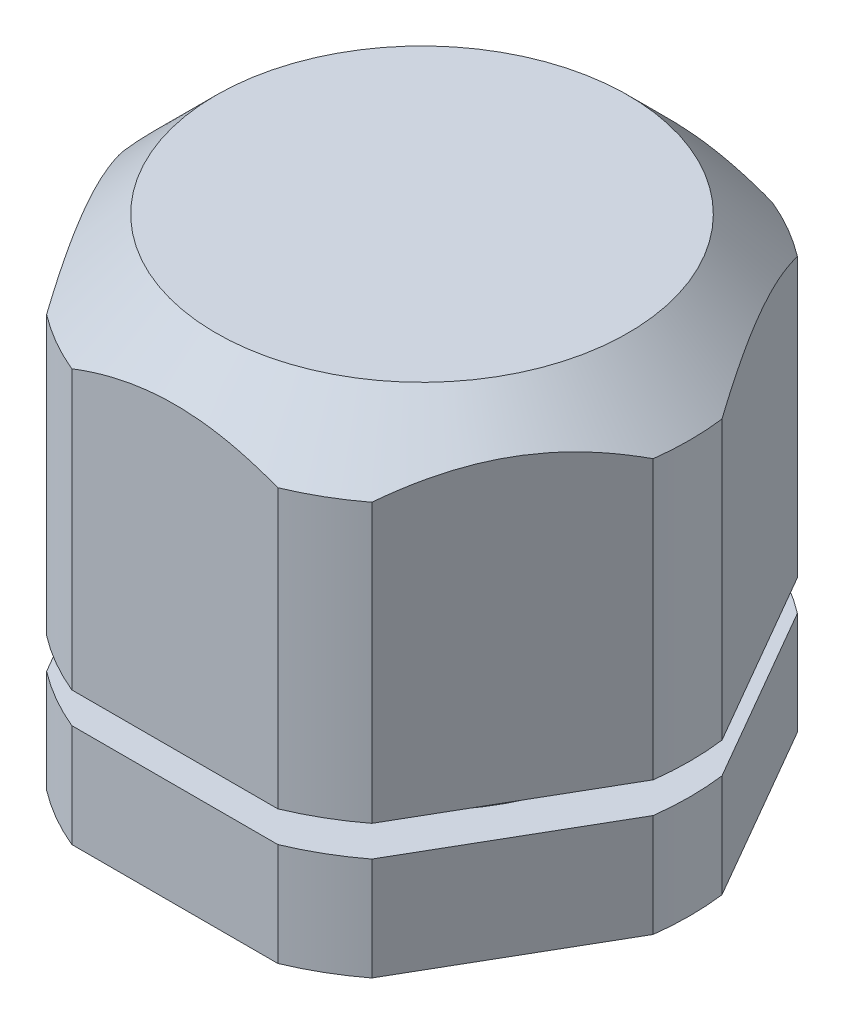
ISO-10303-21;
HEADER;
FILE_DESCRIPTION(('STEP AP214'),'2;1');
FILE_NAME('part.step','',(''),(''),'','','');
FILE_SCHEMA(('AUTOMOTIVE_DESIGN { 1 0 10303 214 1 1 1 1 }'));
ENDSEC;
DATA;
#1=APPLICATION_CONTEXT('core data for automotive mechanical design processes');
#2=APPLICATION_PROTOCOL_DEFINITION('international standard','automotive_design',2000,#1);
#3=PRODUCT_CONTEXT('',#1,'mechanical');
#4=PRODUCT('Part','Part','',(#3));
#5=PRODUCT_RELATED_PRODUCT_CATEGORY('part','',(#4));
#6=PRODUCT_DEFINITION_FORMATION('','',#4);
#7=PRODUCT_DEFINITION_CONTEXT('part definition',#1,'design');
#8=PRODUCT_DEFINITION('design','',#6,#7);
#9=PRODUCT_DEFINITION_SHAPE('','',#8);
#10=(LENGTH_UNIT() NAMED_UNIT(*) SI_UNIT(.MILLI.,.METRE.));
#11=(NAMED_UNIT(*) PLANE_ANGLE_UNIT() SI_UNIT($,.RADIAN.));
#12=(NAMED_UNIT(*) SI_UNIT($,.STERADIAN.) SOLID_ANGLE_UNIT());
#13=UNCERTAINTY_MEASURE_WITH_UNIT(LENGTH_MEASURE(1.E-05),#10,'distance_accuracy_value','');
#14=(GEOMETRIC_REPRESENTATION_CONTEXT(3) GLOBAL_UNCERTAINTY_ASSIGNED_CONTEXT((#13)) GLOBAL_UNIT_ASSIGNED_CONTEXT((#10,
#11,#12)) REPRESENTATION_CONTEXT('',''));
#15=CARTESIAN_POINT('',(0.,0.,0.));
#16=DIRECTION('',(0.,0.,1.));
#17=DIRECTION('',(1.,0.,0.));
#18=AXIS2_PLACEMENT_3D('',#15,#16,#17);
#19=CARTESIAN_POINT('',(0.,0.,0.));
#20=DIRECTION('',(0.,1.,0.));
#21=DIRECTION('',(0.,0.,1.));
#22=AXIS2_PLACEMENT_3D('',#19,#20,#21);
#23=CYLINDRICAL_SURFACE('',#22,13.);
#24=DIRECTION('',(0.,1.,0.));
#25=VECTOR('',#24,1.);
#26=CARTESIAN_POINT('',(12.8923048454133,0.,-1.66987298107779));
#27=LINE('',#26,#25);
#28=CARTESIAN_POINT('',(12.8923048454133,6.5,-1.66987298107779));
#29=VERTEX_POINT('',#28);
#30=CARTESIAN_POINT('',(12.8923048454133,20.,-1.6698729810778));
#31=VERTEX_POINT('',#30);
#32=EDGE_CURVE('E242',#29,#31,#27,.T.);
#33=ORIENTED_EDGE('',*,*,#32,.T.);
#34=CARTESIAN_POINT('',(0.,20.,0.));
#35=DIRECTION('',(0.,1.,0.));
#36=DIRECTION('',(-1.,0.,0.));
#37=AXIS2_PLACEMENT_3D('',#34,#35,#36);
#38=CIRCLE('',#37,13.);
#39=CARTESIAN_POINT('',(12.8923048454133,20.,1.6698729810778));
#40=VERTEX_POINT('',#39);
#41=EDGE_CURVE('E478',#40,#31,#38,.T.);
#42=ORIENTED_EDGE('',*,*,#41,.F.);
#43=DIRECTION('',(0.,1.,0.));
#44=VECTOR('',#43,1.);
#45=CARTESIAN_POINT('',(12.8923048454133,0.,1.66987298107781));
#46=LINE('',#45,#44);
#47=CARTESIAN_POINT('',(12.8923048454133,6.5,1.6698729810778));
#48=VERTEX_POINT('',#47);
#49=EDGE_CURVE('E247',#40,#48,#46,.F.);
#50=ORIENTED_EDGE('',*,*,#49,.T.);
#51=CARTESIAN_POINT('',(0.,6.5,0.));
#52=DIRECTION('',(0.,1.,0.));
#53=DIRECTION('',(-1.,0.,0.));
#54=AXIS2_PLACEMENT_3D('',#51,#52,#53);
#55=CIRCLE('',#54,13.);
#56=EDGE_CURVE('E454',#48,#29,#55,.T.);
#57=ORIENTED_EDGE('',*,*,#56,.T.);
#58=EDGE_LOOP('',(#33,#42,#50,#57));
#59=FACE_BOUND('',#58,.T.);
#60=ADVANCED_FACE('F28',(#59),#23,.T.);
#61=DIRECTION('',(0.,1.,0.));
#62=VECTOR('',#61,1.);
#63=CARTESIAN_POINT('',(5.,0.,-12.));
#64=LINE('',#63,#62);
#65=CARTESIAN_POINT('',(5.,6.5,-12.));
#66=VERTEX_POINT('',#65);
#67=CARTESIAN_POINT('',(5.,20.,-12.));
#68=VERTEX_POINT('',#67);
#69=EDGE_CURVE('E235',#66,#68,#64,.T.);
#70=ORIENTED_EDGE('',*,*,#69,.T.);
#71=CARTESIAN_POINT('',(7.89230484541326,20.,-10.3301270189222));
#72=VERTEX_POINT('',#71);
#73=EDGE_CURVE('E645',#72,#68,#38,.T.);
#74=ORIENTED_EDGE('',*,*,#73,.F.);
#75=DIRECTION('',(0.,1.,0.));
#76=VECTOR('',#75,1.);
#77=CARTESIAN_POINT('',(7.89230484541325,0.,-10.3301270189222));
#78=LINE('',#77,#76);
#79=CARTESIAN_POINT('',(7.89230484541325,6.5,-10.3301270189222));
#80=VERTEX_POINT('',#79);
#81=EDGE_CURVE('E240',#72,#80,#78,.F.);
#82=ORIENTED_EDGE('',*,*,#81,.T.);
#83=EDGE_CURVE('E456',#80,#66,#55,.T.);
#84=ORIENTED_EDGE('',*,*,#83,.T.);
#85=EDGE_LOOP('',(#70,#74,#82,#84));
#86=FACE_BOUND('',#85,.T.);
#87=ADVANCED_FACE('F382',(#86),#23,.T.);
#88=DIRECTION('',(0.,1.,0.));
#89=VECTOR('',#88,1.);
#90=CARTESIAN_POINT('',(-7.89230484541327,0.,-10.3301270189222));
#91=LINE('',#90,#89);
#92=CARTESIAN_POINT('',(-7.89230484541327,6.5,-10.3301270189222));
#93=VERTEX_POINT('',#92);
#94=CARTESIAN_POINT('',(-7.89230484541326,20.,-10.3301270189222));
#95=VERTEX_POINT('',#94);
#96=EDGE_CURVE('E228',#93,#95,#91,.T.);
#97=ORIENTED_EDGE('',*,*,#96,.T.);
#98=CARTESIAN_POINT('',(-5.,20.,-12.));
#99=VERTEX_POINT('',#98);
#100=EDGE_CURVE('E201',#99,#95,#38,.T.);
#101=ORIENTED_EDGE('',*,*,#100,.F.);
#102=DIRECTION('',(0.,1.,0.));
#103=VECTOR('',#102,1.);
#104=CARTESIAN_POINT('',(-5.,0.,-12.));
#105=LINE('',#104,#103);
#106=CARTESIAN_POINT('',(-5.,6.5,-12.));
#107=VERTEX_POINT('',#106);
#108=EDGE_CURVE('E233',#99,#107,#105,.F.);
#109=ORIENTED_EDGE('',*,*,#108,.T.);
#110=EDGE_CURVE('E457',#107,#93,#55,.T.);
#111=ORIENTED_EDGE('',*,*,#110,.T.);
#112=EDGE_LOOP('',(#97,#101,#109,#111));
#113=FACE_BOUND('',#112,.T.);
#114=ADVANCED_FACE('F389',(#113),#23,.T.);
#115=DIRECTION('',(0.,1.,0.));
#116=VECTOR('',#115,1.);
#117=CARTESIAN_POINT('',(-12.8923048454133,0.,1.6698729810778));
#118=LINE('',#117,#116);
#119=CARTESIAN_POINT('',(-12.8923048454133,6.5,1.66987298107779));
#120=VERTEX_POINT('',#119);
#121=CARTESIAN_POINT('',(-12.8923048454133,20.,1.66987298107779));
#122=VERTEX_POINT('',#121);
#123=EDGE_CURVE('E210',#120,#122,#118,.T.);
#124=ORIENTED_EDGE('',*,*,#123,.T.);
#125=CARTESIAN_POINT('',(-12.8923048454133,20.,-1.6698729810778));
#126=VERTEX_POINT('',#125);
#127=EDGE_CURVE('E191',#126,#122,#38,.T.);
#128=ORIENTED_EDGE('',*,*,#127,.F.);
#129=DIRECTION('',(0.,1.,0.));
#130=VECTOR('',#129,1.);
#131=CARTESIAN_POINT('',(-12.8923048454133,0.,-1.66987298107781));
#132=LINE('',#131,#130);
#133=CARTESIAN_POINT('',(-12.8923048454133,6.5,-1.66987298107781));
#134=VERTEX_POINT('',#133);
#135=EDGE_CURVE('E226',#126,#134,#132,.F.);
#136=ORIENTED_EDGE('',*,*,#135,.T.);
#137=EDGE_CURVE('E217',#134,#120,#55,.T.);
#138=ORIENTED_EDGE('',*,*,#137,.T.);
#139=EDGE_LOOP('',(#124,#128,#136,#138));
#140=FACE_BOUND('',#139,.T.);
#141=ADVANCED_FACE('F215',(#140),#23,.T.);
#142=DIRECTION('',(0.,1.,0.));
#143=VECTOR('',#142,1.);
#144=CARTESIAN_POINT('',(-5.,0.,12.));
#145=LINE('',#144,#143);
#146=CARTESIAN_POINT('',(-5.,6.5,12.));
#147=VERTEX_POINT('',#146);
#148=CARTESIAN_POINT('',(-5.,20.,12.));
#149=VERTEX_POINT('',#148);
#150=EDGE_CURVE('E292',#147,#149,#145,.T.);
#151=ORIENTED_EDGE('',*,*,#150,.T.);
#152=CARTESIAN_POINT('',(-7.89230484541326,20.,10.3301270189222));
#153=VERTEX_POINT('',#152);
#154=EDGE_CURVE('E204',#153,#149,#38,.T.);
#155=ORIENTED_EDGE('',*,*,#154,.F.);
#156=DIRECTION('',(0.,1.,0.));
#157=VECTOR('',#156,1.);
#158=CARTESIAN_POINT('',(-7.89230484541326,0.,10.3301270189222));
#159=LINE('',#158,#157);
#160=CARTESIAN_POINT('',(-7.89230484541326,6.5,10.3301270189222));
#161=VERTEX_POINT('',#160);
#162=EDGE_CURVE('E211',#153,#161,#159,.F.);
#163=ORIENTED_EDGE('',*,*,#162,.T.);
#164=EDGE_CURVE('E305',#161,#147,#55,.T.);
#165=ORIENTED_EDGE('',*,*,#164,.T.);
#166=EDGE_LOOP('',(#151,#155,#163,#165));
#167=FACE_BOUND('',#166,.T.);
#168=ADVANCED_FACE('F303',(#167),#23,.T.);
#169=DIRECTION('',(0.,1.,0.));
#170=VECTOR('',#169,1.);
#171=CARTESIAN_POINT('',(7.89230484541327,0.,10.3301270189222));
#172=LINE('',#171,#170);
#173=CARTESIAN_POINT('',(7.89230484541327,6.5,10.3301270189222));
#174=VERTEX_POINT('',#173);
#175=CARTESIAN_POINT('',(7.89230484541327,20.,10.3301270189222));
#176=VERTEX_POINT('',#175);
#177=EDGE_CURVE('E249',#174,#176,#172,.T.);
#178=ORIENTED_EDGE('',*,*,#177,.T.);
#179=CARTESIAN_POINT('',(5.,20.,12.));
#180=VERTEX_POINT('',#179);
#181=EDGE_CURVE('E47',#180,#176,#38,.T.);
#182=ORIENTED_EDGE('',*,*,#181,.F.);
#183=DIRECTION('',(0.,1.,0.));
#184=VECTOR('',#183,1.);
#185=CARTESIAN_POINT('',(5.00000000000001,0.,12.));
#186=LINE('',#185,#184);
#187=CARTESIAN_POINT('',(5.00000000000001,6.5,12.));
#188=VERTEX_POINT('',#187);
#189=EDGE_CURVE('E289',#180,#188,#186,.F.);
#190=ORIENTED_EDGE('',*,*,#189,.T.);
#191=CARTESIAN_POINT('',(0.,6.5,0.));
#192=DIRECTION('',(0.,-1.,0.));
#193=DIRECTION('',(1.,0.,0.));
#194=AXIS2_PLACEMENT_3D('',#191,#192,#193);
#195=CIRCLE('',#194,13.);
#196=EDGE_CURVE('E275',#188,#174,#195,.F.);
#197=ORIENTED_EDGE('',*,*,#196,.T.);
#198=EDGE_LOOP('',(#178,#182,#190,#197));
#199=FACE_BOUND('',#198,.T.);
#200=ADVANCED_FACE('F402',(#199),#23,.T.);
#201=CARTESIAN_POINT('',(-6.92820323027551,23.,12.));
#202=DIRECTION('',(0.,0.,-1.));
#203=DIRECTION('',(-1.,0.,0.));
#204=AXIS2_PLACEMENT_3D('',#201,#202,#203);
#205=PLANE('',#204);
#206=CARTESIAN_POINT('',(-9.30729947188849,17.8136303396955,12.));
#207=CARTESIAN_POINT('',(-9.08062642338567,17.952531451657,12.));
#208=CARTESIAN_POINT('',(-8.85254379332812,18.0891674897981,12.));
#209=CARTESIAN_POINT('',(-8.3932473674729,18.3571980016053,12.));
#210=CARTESIAN_POINT('',(-8.16203281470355,18.4885911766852,12.));
#211=CARTESIAN_POINT('',(-7.69528106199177,18.7459016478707,12.));
#212=CARTESIAN_POINT('',(-7.45972965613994,18.8717932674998,12.));
#213=CARTESIAN_POINT('',(-6.98503280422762,19.11658124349,12.));
#214=CARTESIAN_POINT('',(-6.74588759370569,19.2354780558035,12.));
#215=CARTESIAN_POINT('',(-6.25881872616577,19.4675922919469,12.));
#216=CARTESIAN_POINT('',(-6.01081554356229,19.5806440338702,12.));
#217=CARTESIAN_POINT('',(-5.51064181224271,19.7971100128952,12.));
#218=CARTESIAN_POINT('',(-5.2584708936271,19.9005233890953,12.));
#219=CARTESIAN_POINT('',(-4.49633259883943,20.1938457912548,12.));
#220=CARTESIAN_POINT('',(-3.97974494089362,20.3673229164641,12.));
#221=CARTESIAN_POINT('',(-3.15640427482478,20.5951498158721,12.));
#222=CARTESIAN_POINT('',(-2.85488991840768,20.6686547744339,12.));
#223=CARTESIAN_POINT('',(-2.24746921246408,20.7949626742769,12.));
#224=CARTESIAN_POINT('',(-1.94156264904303,20.8477646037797,12.));
#225=CARTESIAN_POINT('',(-1.3295072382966,20.930346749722,12.));
#226=CARTESIAN_POINT('',(-1.02338673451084,20.9603351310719,12.));
#227=CARTESIAN_POINT('',(-0.40973577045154,20.9969146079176,12.));
#228=CARTESIAN_POINT('',(-0.102205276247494,21.0035051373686,12.));
#229=CARTESIAN_POINT('',(0.565779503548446,20.9920764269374,12.));
#230=CARTESIAN_POINT('',(0.926164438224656,20.9695918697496,12.));
#231=CARTESIAN_POINT('',(1.64359606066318,20.893223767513,12.));
#232=CARTESIAN_POINT('',(2.0006420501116,20.8393337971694,12.));
#233=CARTESIAN_POINT('',(2.71374398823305,20.7020191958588,12.));
#234=CARTESIAN_POINT('',(3.06972697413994,20.618220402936,12.));
#235=CARTESIAN_POINT('',(3.77449079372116,20.4249505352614,12.));
#236=CARTESIAN_POINT('',(4.12327285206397,20.3154838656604,12.));
#237=CARTESIAN_POINT('',(4.8706213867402,20.0547051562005,12.));
#238=CARTESIAN_POINT('',(5.26780567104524,19.8994603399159,12.));
#239=CARTESIAN_POINT('',(6.05200996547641,19.5649366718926,12.));
#240=CARTESIAN_POINT('',(6.4390250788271,19.3856464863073,12.));
#241=CARTESIAN_POINT('',(7.20475189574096,19.0072412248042,12.));
#242=CARTESIAN_POINT('',(7.58343202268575,18.8080627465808,12.));
#243=CARTESIAN_POINT('',(8.3321321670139,18.3942779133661,12.));
#244=CARTESIAN_POINT('',(8.70215354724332,18.1796740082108,12.));
#245=CARTESIAN_POINT('',(9.4189251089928,17.7475254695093,12.));
#246=CARTESIAN_POINT('',(9.76599203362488,17.5305034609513,12.));
#247=CARTESIAN_POINT('',(10.4541301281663,17.0871234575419,12.));
#248=CARTESIAN_POINT('',(10.7952008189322,16.8607647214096,12.));
#249=CARTESIAN_POINT('',(11.4693429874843,16.4022545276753,12.));
#250=CARTESIAN_POINT('',(11.8024570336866,16.1701654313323,12.));
#251=CARTESIAN_POINT('',(12.4640878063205,15.6997130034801,12.));
#252=CARTESIAN_POINT('',(12.7926058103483,15.4613514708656,12.));
#253=CARTESIAN_POINT('',(13.119197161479,15.2204236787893,12.));
#254=B_SPLINE_CURVE_WITH_KNOTS('',3,(#206,#207,#208,#209,#210,#211,#212,#213,#214,#215,#216,
#217,#218,#219,#220,#221,#222,#223,#224,#225,#226,#227,#228,#229,#230,#231,#232,#233,#234,#235,
#236,#237,#238,#239,#240,#241,#242,#243,#244,#245,#246,#247,#248,#249,#250,#251,#252,#253),
.UNSPECIFIED.,.F.,.F.,(4,2,2,2,2,2,2,2,2,2,2,2,2,2,2,2,2,2,2,2,2,2,2,4),(0.,0.797552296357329,
1.59530092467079,2.39644369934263,3.19753419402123,4.01499296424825,4.83252468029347,
6.46427587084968,7.39471880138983,8.32520719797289,9.24709989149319,10.1690148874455,
11.2507838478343,12.3327742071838,13.428804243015,14.5246463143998,15.802983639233,
17.0819256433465,18.3650835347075,19.6480380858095,20.8758633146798,22.1037862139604,
23.3216866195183,24.5392414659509),.UNSPECIFIED.);
#255=EDGE_CURVE('E212',#149,#180,#254,.T.);
#256=ORIENTED_EDGE('',*,*,#255,.F.);
#257=ORIENTED_EDGE('',*,*,#150,.F.);
#258=DIRECTION('',(-1.,0.,0.));
#259=VECTOR('',#258,1.);
#260=CARTESIAN_POINT('',(-6.92820323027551,6.5,12.));
#261=LINE('',#260,#259);
#262=EDGE_CURVE('E311',#188,#147,#261,.T.);
#263=ORIENTED_EDGE('',*,*,#262,.F.);
#264=ORIENTED_EDGE('',*,*,#189,.F.);
#265=EDGE_LOOP('',(#256,#257,#263,#264));
#266=FACE_BOUND('',#265,.T.);
#267=ADVANCED_FACE('F309',(#266),#205,.F.);
#268=CARTESIAN_POINT('',(-13.856406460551,23.,0.));
#269=DIRECTION('',(0.866025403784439,0.,-0.5));
#270=DIRECTION('',(-0.5,0.,-0.866025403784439));
#271=AXIS2_PLACEMENT_3D('',#268,#269,#270);
#272=PLANE('',#271);
#273=CARTESIAN_POINT('',(-12.8924203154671,19.9999111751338,1.66967298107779));
#274=CARTESIAN_POINT('',(-12.7942572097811,20.0754200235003,1.83969646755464));
#275=CARTESIAN_POINT('',(-12.6954616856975,20.1476334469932,2.01081533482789));
#276=CARTESIAN_POINT('',(-12.4965771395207,20.2847752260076,2.35529347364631));
#277=CARTESIAN_POINT('',(-12.396487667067,20.3497009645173,2.52865352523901));
#278=CARTESIAN_POINT('',(-12.0938524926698,20.5327223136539,3.0528330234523));
#279=CARTESIAN_POINT('',(-11.8894168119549,20.6386882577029,3.40692600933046));
#280=CARTESIAN_POINT('',(-11.4839998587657,20.8091745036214,4.10912877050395));
#281=CARTESIAN_POINT('',(-11.2831662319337,20.8750704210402,4.45698281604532));
#282=CARTESIAN_POINT('',(-10.9803905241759,20.9441694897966,4.98140572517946));
#283=CARTESIAN_POINT('',(-10.8792618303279,20.9622434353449,5.15656576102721));
#284=CARTESIAN_POINT('',(-10.6766822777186,20.9882279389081,5.50744383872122));
#285=CARTESIAN_POINT('',(-10.5752314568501,20.9961396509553,5.68316181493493));
#286=CARTESIAN_POINT('',(-10.3657329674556,21.0018267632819,6.04602384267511));
#287=CARTESIAN_POINT('',(-10.2576805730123,20.9989176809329,6.23317607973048));
#288=CARTESIAN_POINT('',(-10.0418097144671,20.9814785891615,6.60707537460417));
#289=CARTESIAN_POINT('',(-9.93399125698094,20.9669482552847,6.79382242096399));
#290=CARTESIAN_POINT('',(-9.71873275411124,20.9265243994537,7.16666108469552));
#291=CARTESIAN_POINT('',(-9.61129347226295,20.9006146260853,7.35275137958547));
#292=CARTESIAN_POINT('',(-9.39720527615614,20.8379286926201,7.72356301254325));
#293=CARTESIAN_POINT('',(-9.29055650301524,20.8011506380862,7.90828410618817));
#294=CARTESIAN_POINT('',(-8.96359505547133,20.672074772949,8.47459794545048));
#295=CARTESIAN_POINT('',(-8.7449135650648,20.5627121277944,8.85336539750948));
#296=CARTESIAN_POINT('',(-8.42151401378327,20.3709220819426,9.41350985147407));
#297=CARTESIAN_POINT('',(-8.31462148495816,20.3024753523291,9.59865314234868));
#298=CARTESIAN_POINT('',(-8.1023130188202,20.1572359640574,9.96638219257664));
#299=CARTESIAN_POINT('',(-7.9968964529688,20.080446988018,10.1489690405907));
#300=CARTESIAN_POINT('',(-7.89218937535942,19.9999111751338,10.3303270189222));
#301=B_SPLINE_CURVE_WITH_KNOTS('',3,(#273,#274,#275,#276,#277,#278,#279,#280,#281,#282,#283,
#284,#285,#286,#287,#288,#289,#290,#291,#292,#293,#294,#295,#296,#297,#298,#299,#300),
.UNSPECIFIED.,.F.,.F.,(4,2,2,2,2,2,2,2,2,2,2,2,2,4),(0.,0.630990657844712,1.26220718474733,
2.52770463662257,3.74686035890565,4.35583184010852,4.96473415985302,5.6127892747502,
6.26086248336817,6.90986425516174,7.55897922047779,8.90909978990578,9.58240015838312,
10.255404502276),.UNSPECIFIED.);
#302=EDGE_CURVE('E194',#122,#153,#301,.T.);
#303=ORIENTED_EDGE('',*,*,#302,.F.);
#304=ORIENTED_EDGE('',*,*,#123,.F.);
#305=DIRECTION('',(-0.5,0.,-0.866025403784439));
#306=VECTOR('',#305,1.);
#307=CARTESIAN_POINT('',(-13.856406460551,6.5,0.));
#308=LINE('',#307,#306);
#309=EDGE_CURVE('E616',#161,#120,#308,.T.);
#310=ORIENTED_EDGE('',*,*,#309,.F.);
#311=ORIENTED_EDGE('',*,*,#162,.F.);
#312=EDGE_LOOP('',(#303,#304,#310,#311));
#313=FACE_BOUND('',#312,.T.);
#314=ADVANCED_FACE('F208',(#313),#272,.F.);
#315=CARTESIAN_POINT('',(-6.92820323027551,23.,-12.));
#316=DIRECTION('',(0.866025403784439,0.,0.5));
#317=DIRECTION('',(0.5,0.,-0.866025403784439));
#318=AXIS2_PLACEMENT_3D('',#315,#316,#317);
#319=PLANE('',#318);
#320=CARTESIAN_POINT('',(-7.89218937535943,19.9999111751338,-10.3303270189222));
#321=CARTESIAN_POINT('',(-7.9903524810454,20.0754200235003,-10.1603035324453));
#322=CARTESIAN_POINT('',(-8.08914800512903,20.1476334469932,-9.98918466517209));
#323=CARTESIAN_POINT('',(-8.28803255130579,20.2847752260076,-9.64470652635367));
#324=CARTESIAN_POINT('',(-8.38812202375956,20.3497009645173,-9.47134647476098));
#325=CARTESIAN_POINT('',(-8.69075719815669,20.5327223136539,-8.94716697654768));
#326=CARTESIAN_POINT('',(-8.8951928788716,20.6386882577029,-8.59307399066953));
#327=CARTESIAN_POINT('',(-9.30060983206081,20.8091745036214,-7.89087122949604));
#328=CARTESIAN_POINT('',(-9.50144345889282,20.8750704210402,-7.54301718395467));
#329=CARTESIAN_POINT('',(-9.80421916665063,20.9441694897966,-7.01859427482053));
#330=CARTESIAN_POINT('',(-9.90534786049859,20.9622434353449,-6.84343423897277));
#331=CARTESIAN_POINT('',(-10.107927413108,20.9882279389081,-6.49255616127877));
#332=CARTESIAN_POINT('',(-10.2093782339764,20.9961396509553,-6.31683818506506));
#333=CARTESIAN_POINT('',(-10.4188767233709,21.0018267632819,-5.95397615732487));
#334=CARTESIAN_POINT('',(-10.5269291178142,20.9989176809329,-5.76682392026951));
#335=CARTESIAN_POINT('',(-10.7427999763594,20.9814785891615,-5.39292462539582));
#336=CARTESIAN_POINT('',(-10.8506184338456,20.9669482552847,-5.206177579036));
#337=CARTESIAN_POINT('',(-11.0658769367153,20.9265243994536,-4.83333891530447));
#338=CARTESIAN_POINT('',(-11.1733162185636,20.9006146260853,-4.64724862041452));
#339=CARTESIAN_POINT('',(-11.3874044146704,20.8379286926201,-4.27643698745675));
#340=CARTESIAN_POINT('',(-11.4940531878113,20.8011506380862,-4.09171589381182));
#341=CARTESIAN_POINT('',(-11.8210146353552,20.672074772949,-3.52540205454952));
#342=CARTESIAN_POINT('',(-12.0396961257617,20.5627121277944,-3.14663460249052));
#343=CARTESIAN_POINT('',(-12.3630956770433,20.3709220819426,-2.58649014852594));
#344=CARTESIAN_POINT('',(-12.4699882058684,20.3024753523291,-2.40134685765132));
#345=CARTESIAN_POINT('',(-12.6822966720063,20.1572359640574,-2.03361780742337));
#346=CARTESIAN_POINT('',(-12.7877132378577,20.080446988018,-1.8510309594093));
#347=CARTESIAN_POINT('',(-12.8924203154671,19.9999111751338,-1.66967298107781));
#348=B_SPLINE_CURVE_WITH_KNOTS('',3,(#320,#321,#322,#323,#324,#325,#326,#327,#328,#329,#330,
#331,#332,#333,#334,#335,#336,#337,#338,#339,#340,#341,#342,#343,#344,#345,#346,#347),
.UNSPECIFIED.,.F.,.F.,(4,2,2,2,2,2,2,2,2,2,2,2,2,4),(0.,0.630990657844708,1.26220718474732,
2.52770463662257,3.74686035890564,4.35583184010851,4.96473415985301,5.61278927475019,
6.26086248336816,6.90986425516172,7.55897922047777,8.90909978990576,9.58240015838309,
10.255404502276),.UNSPECIFIED.);
#349=EDGE_CURVE('E197',#95,#126,#348,.T.);
#350=ORIENTED_EDGE('',*,*,#349,.F.);
#351=ORIENTED_EDGE('',*,*,#96,.F.);
#352=DIRECTION('',(0.5,0.,-0.866025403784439));
#353=VECTOR('',#352,1.);
#354=CARTESIAN_POINT('',(-6.92820323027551,6.5,-12.));
#355=LINE('',#354,#353);
#356=EDGE_CURVE('E615',#134,#93,#355,.T.);
#357=ORIENTED_EDGE('',*,*,#356,.F.);
#358=ORIENTED_EDGE('',*,*,#135,.F.);
#359=EDGE_LOOP('',(#350,#351,#357,#358));
#360=FACE_BOUND('',#359,.T.);
#361=ADVANCED_FACE('F362',(#360),#319,.F.);
#362=CARTESIAN_POINT('',(6.92820323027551,23.,-12.));
#363=DIRECTION('',(0.,0.,1.));
#364=DIRECTION('',(1.,0.,0.));
#365=AXIS2_PLACEMENT_3D('',#362,#363,#364);
#366=PLANE('',#365);
#367=CARTESIAN_POINT('',(-9.30729947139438,17.8136303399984,-12.));
#368=CARTESIAN_POINT('',(-9.08062642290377,17.9525314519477,-12.));
#369=CARTESIAN_POINT('',(-8.85254379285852,18.0891674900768,-12.));
#370=CARTESIAN_POINT('',(-8.39324736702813,18.3571980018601,-12.));
#371=CARTESIAN_POINT('',(-8.1620328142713,18.4885911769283,-12.));
#372=CARTESIAN_POINT('',(-7.695281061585,18.7459016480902,-12.));
#373=CARTESIAN_POINT('',(-7.45972965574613,18.8717932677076,-12.));
#374=CARTESIAN_POINT('',(-6.98503280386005,19.1165812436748,-12.));
#375=CARTESIAN_POINT('',(-6.74588759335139,19.2354780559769,-12.));
#376=CARTESIAN_POINT('',(-6.2588187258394,19.4675922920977,-12.));
#377=CARTESIAN_POINT('',(-6.01081554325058,19.5806440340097,-12.));
#378=CARTESIAN_POINT('',(-5.51064181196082,19.7971100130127,-12.));
#379=CARTESIAN_POINT('',(-5.25847089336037,19.9005233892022,-12.));
#380=CARTESIAN_POINT('',(-4.49633259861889,20.1938457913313,-12.));
#381=CARTESIAN_POINT('',(-3.97974494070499,20.3673229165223,-12.));
#382=CARTESIAN_POINT('',(-3.15640427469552,20.5951498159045,-12.));
#383=CARTESIAN_POINT('',(-2.85488991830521,20.668654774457,-12.));
#384=CARTESIAN_POINT('',(-2.24746921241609,20.7949626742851,-12.));
#385=CARTESIAN_POINT('',(-1.94156264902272,20.8477646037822,-12.));
#386=CARTESIAN_POINT('',(-1.32950723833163,20.9303467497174,-12.));
#387=CARTESIAN_POINT('',(-1.02338673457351,20.9603351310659,-12.));
#388=CARTESIAN_POINT('',(-0.40973577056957,20.9969146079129,-12.));
#389=CARTESIAN_POINT('',(-0.102205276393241,21.0035051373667,-12.));
#390=CARTESIAN_POINT('',(0.56577950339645,20.9920764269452,-12.));
#391=CARTESIAN_POINT('',(0.926164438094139,20.9695918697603,-12.));
#392=CARTESIAN_POINT('',(1.64359606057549,20.8932237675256,-12.));
#393=CARTESIAN_POINT('',(2.00064205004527,20.8393337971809,-12.));
#394=CARTESIAN_POINT('',(2.7137439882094,20.7020191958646,-12.));
#395=CARTESIAN_POINT('',(3.06972697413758,20.6182204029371,-12.));
#396=CARTESIAN_POINT('',(3.77449079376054,20.4249505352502,-12.));
#397=CARTESIAN_POINT('',(4.12327285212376,20.3154838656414,-12.));
#398=CARTESIAN_POINT('',(4.87062138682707,20.054705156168,-12.));
#399=CARTESIAN_POINT('',(5.26780567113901,19.8994603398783,-12.));
#400=CARTESIAN_POINT('',(6.05200996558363,19.5649366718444,-12.));
#401=CARTESIAN_POINT('',(6.43902507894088,19.3856464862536,-12.));
#402=CARTESIAN_POINT('',(7.20475189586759,19.0072412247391,-12.));
#403=CARTESIAN_POINT('',(7.58343202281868,18.8080627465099,-12.));
#404=CARTESIAN_POINT('',(8.33213216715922,18.3942779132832,-12.));
#405=CARTESIAN_POINT('',(8.70215354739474,18.179674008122,-12.));
#406=CARTESIAN_POINT('',(9.41892510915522,17.747525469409,-12.));
#407=CARTESIAN_POINT('',(9.76599203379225,17.5305034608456,-12.));
#408=CARTESIAN_POINT('',(10.4541301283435,17.0871234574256,-12.));
#409=CARTESIAN_POINT('',(10.7952008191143,16.8607647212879,-12.));
#410=CARTESIAN_POINT('',(11.469342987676,16.4022545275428,-12.));
#411=CARTESIAN_POINT('',(11.8024570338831,16.1701654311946,-12.));
#412=CARTESIAN_POINT('',(12.4640878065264,15.6997130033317,-12.));
#413=CARTESIAN_POINT('',(12.7926058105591,15.4613514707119,-12.));
#414=CARTESIAN_POINT('',(13.1191971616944,15.2204236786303,-12.));
#415=B_SPLINE_CURVE_WITH_KNOTS('',3,(#367,#368,#369,#370,#371,#372,#373,#374,#375,#376,#377,
#378,#379,#380,#381,#382,#383,#384,#385,#386,#387,#388,#389,#390,#391,#392,#393,#394,#395,#396,
#397,#398,#399,#400,#401,#402,#403,#404,#405,#406,#407,#408,#409,#410,#411,#412,#413,#414),
.UNSPECIFIED.,.F.,.F.,(4,2,2,2,2,2,2,2,2,2,2,2,2,2,2,2,2,2,2,2,2,2,2,4),(0.,0.797552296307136,
1.59530092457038,2.39644369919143,3.19753419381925,4.01499296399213,4.83252467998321,
6.46427587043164,7.39471880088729,8.32520719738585,9.2470998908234,10.1690148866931,
11.2507838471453,12.3327742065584,13.4288042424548,14.5246463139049,15.8029836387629,
17.0819256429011,18.365083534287,19.6480380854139,20.8758633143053,22.103786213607,
23.3216866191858,24.5392414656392),.UNSPECIFIED.);
#416=EDGE_CURVE('E347',#68,#99,#415,.F.);
#417=ORIENTED_EDGE('',*,*,#416,.F.);
#418=ORIENTED_EDGE('',*,*,#69,.F.);
#419=DIRECTION('',(1.,0.,0.));
#420=VECTOR('',#419,1.);
#421=CARTESIAN_POINT('',(6.92820323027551,6.5,-12.));
#422=LINE('',#421,#420);
#423=EDGE_CURVE('E475',#107,#66,#422,.T.);
#424=ORIENTED_EDGE('',*,*,#423,.F.);
#425=ORIENTED_EDGE('',*,*,#108,.F.);
#426=EDGE_LOOP('',(#417,#418,#424,#425));
#427=FACE_BOUND('',#426,.T.);
#428=ADVANCED_FACE('F368',(#427),#366,.F.);
#429=CARTESIAN_POINT('',(13.856406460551,23.,0.));
#430=DIRECTION('',(-0.866025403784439,0.,0.5));
#431=DIRECTION('',(0.5,0.,0.866025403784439));
#432=AXIS2_PLACEMENT_3D('',#429,#430,#431);
#433=PLANE('',#432);
#434=CARTESIAN_POINT('',(12.8924203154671,19.9999111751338,-1.66967298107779));
#435=CARTESIAN_POINT('',(12.7942572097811,20.0754200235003,-1.83969646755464));
#436=CARTESIAN_POINT('',(12.6954616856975,20.1476334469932,-2.01081533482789));
#437=CARTESIAN_POINT('',(12.4965771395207,20.2847752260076,-2.35529347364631));
#438=CARTESIAN_POINT('',(12.396487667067,20.3497009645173,-2.52865352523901));
#439=CARTESIAN_POINT('',(12.0938524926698,20.5327223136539,-3.05283302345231));
#440=CARTESIAN_POINT('',(11.8894168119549,20.6386882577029,-3.40692600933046));
#441=CARTESIAN_POINT('',(11.4839998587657,20.8091745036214,-4.10912877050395));
#442=CARTESIAN_POINT('',(11.2831662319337,20.8750704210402,-4.45698281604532));
#443=CARTESIAN_POINT('',(10.9803905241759,20.9441694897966,-4.98140572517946));
#444=CARTESIAN_POINT('',(10.8792618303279,20.9622434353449,-5.15656576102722));
#445=CARTESIAN_POINT('',(10.6766822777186,20.9882279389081,-5.50744383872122));
#446=CARTESIAN_POINT('',(10.5752314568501,20.9961396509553,-5.68316181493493));
#447=CARTESIAN_POINT('',(10.3657329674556,21.0018267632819,-6.04602384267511));
#448=CARTESIAN_POINT('',(10.2576805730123,20.9989176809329,-6.23317607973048));
#449=CARTESIAN_POINT('',(10.0418097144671,20.9814785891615,-6.60707537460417));
#450=CARTESIAN_POINT('',(9.93399125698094,20.9669482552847,-6.79382242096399));
#451=CARTESIAN_POINT('',(9.71873275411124,20.9265243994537,-7.16666108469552));
#452=CARTESIAN_POINT('',(9.61129347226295,20.9006146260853,-7.35275137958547));
#453=CARTESIAN_POINT('',(9.39720527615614,20.8379286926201,-7.72356301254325));
#454=CARTESIAN_POINT('',(9.29055650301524,20.8011506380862,-7.90828410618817));
#455=CARTESIAN_POINT('',(8.96359505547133,20.672074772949,-8.47459794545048));
#456=CARTESIAN_POINT('',(8.7449135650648,20.5627121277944,-8.85336539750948));
#457=CARTESIAN_POINT('',(8.42151401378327,20.3709220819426,-9.41350985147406));
#458=CARTESIAN_POINT('',(8.31462148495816,20.3024753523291,-9.59865314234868));
#459=CARTESIAN_POINT('',(8.1023130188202,20.1572359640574,-9.96638219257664));
#460=CARTESIAN_POINT('',(7.99689645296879,20.080446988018,-10.1489690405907));
#461=CARTESIAN_POINT('',(7.89218937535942,19.9999111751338,-10.3303270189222));
#462=B_SPLINE_CURVE_WITH_KNOTS('',3,(#434,#435,#436,#437,#438,#439,#440,#441,#442,#443,#444,
#445,#446,#447,#448,#449,#450,#451,#452,#453,#454,#455,#456,#457,#458,#459,#460,#461),
.UNSPECIFIED.,.F.,.F.,(4,2,2,2,2,2,2,2,2,2,2,2,2,4),(0.,0.630990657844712,1.26220718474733,
2.52770463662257,3.74686035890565,4.35583184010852,4.96473415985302,5.6127892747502,
6.26086248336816,6.90986425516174,7.55897922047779,8.90909978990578,9.58240015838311,
10.255404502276),.UNSPECIFIED.);
#463=EDGE_CURVE('E341',#31,#72,#462,.T.);
#464=ORIENTED_EDGE('',*,*,#463,.F.);
#465=ORIENTED_EDGE('',*,*,#32,.F.);
#466=DIRECTION('',(0.5,0.,0.866025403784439));
#467=VECTOR('',#466,1.);
#468=CARTESIAN_POINT('',(13.856406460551,6.5,0.));
#469=LINE('',#468,#467);
#470=EDGE_CURVE('E622',#80,#29,#469,.T.);
#471=ORIENTED_EDGE('',*,*,#470,.F.);
#472=ORIENTED_EDGE('',*,*,#81,.F.);
#473=EDGE_LOOP('',(#464,#465,#471,#472));
#474=FACE_BOUND('',#473,.T.);
#475=ADVANCED_FACE('F372',(#474),#433,.F.);
#476=CARTESIAN_POINT('',(6.92820323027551,23.,12.));
#477=DIRECTION('',(-0.866025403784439,0.,-0.5));
#478=DIRECTION('',(-0.5,0.,0.866025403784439));
#479=AXIS2_PLACEMENT_3D('',#476,#477,#478);
#480=PLANE('',#479);
#481=CARTESIAN_POINT('',(7.89218937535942,19.9999111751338,10.3303270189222));
#482=CARTESIAN_POINT('',(7.99035248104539,20.0754200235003,10.1603035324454));
#483=CARTESIAN_POINT('',(8.08914800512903,20.1476334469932,9.9891846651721));
#484=CARTESIAN_POINT('',(8.28803255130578,20.2847752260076,9.64470652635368));
#485=CARTESIAN_POINT('',(8.38812202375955,20.3497009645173,9.47134647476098));
#486=CARTESIAN_POINT('',(8.69075719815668,20.5327223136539,8.94716697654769));
#487=CARTESIAN_POINT('',(8.89519287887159,20.6386882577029,8.59307399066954));
#488=CARTESIAN_POINT('',(9.3006098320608,20.8091745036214,7.89087122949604));
#489=CARTESIAN_POINT('',(9.50144345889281,20.8750704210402,7.54301718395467));
#490=CARTESIAN_POINT('',(9.80421916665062,20.9441694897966,7.01859427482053));
#491=CARTESIAN_POINT('',(9.90534786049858,20.9622434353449,6.84343423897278));
#492=CARTESIAN_POINT('',(10.107927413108,20.9882279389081,6.49255616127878));
#493=CARTESIAN_POINT('',(10.2093782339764,20.9961396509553,6.31683818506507));
#494=CARTESIAN_POINT('',(10.4188767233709,21.0018267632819,5.95397615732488));
#495=CARTESIAN_POINT('',(10.5269291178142,20.9989176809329,5.76682392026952));
#496=CARTESIAN_POINT('',(10.7427999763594,20.9814785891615,5.39292462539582));
#497=CARTESIAN_POINT('',(10.8506184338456,20.9669482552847,5.206177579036));
#498=CARTESIAN_POINT('',(11.0658769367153,20.9265243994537,4.83333891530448));
#499=CARTESIAN_POINT('',(11.1733162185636,20.9006146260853,4.64724862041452));
#500=CARTESIAN_POINT('',(11.3874044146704,20.8379286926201,4.27643698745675));
#501=CARTESIAN_POINT('',(11.4940531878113,20.8011506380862,4.09171589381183));
#502=CARTESIAN_POINT('',(11.8210146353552,20.672074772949,3.52540205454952));
#503=CARTESIAN_POINT('',(12.0396961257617,20.5627121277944,3.14663460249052));
#504=CARTESIAN_POINT('',(12.3630956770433,20.3709220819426,2.58649014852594));
#505=CARTESIAN_POINT('',(12.4699882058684,20.3024753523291,2.40134685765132));
#506=CARTESIAN_POINT('',(12.6822966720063,20.1572359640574,2.03361780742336));
#507=CARTESIAN_POINT('',(12.7877132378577,20.080446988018,1.8510309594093));
#508=CARTESIAN_POINT('',(12.8924203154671,19.9999111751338,1.6696729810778));
#509=B_SPLINE_CURVE_WITH_KNOTS('',3,(#481,#482,#483,#484,#485,#486,#487,#488,#489,#490,#491,
#492,#493,#494,#495,#496,#497,#498,#499,#500,#501,#502,#503,#504,#505,#506,#507,#508),
.UNSPECIFIED.,.F.,.F.,(4,2,2,2,2,2,2,2,2,2,2,2,2,4),(0.,0.630990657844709,1.26220718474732,
2.52770463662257,3.74686035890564,4.35583184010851,4.96473415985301,5.61278927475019,
6.26086248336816,6.90986425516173,7.55897922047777,8.90909978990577,9.5824001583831,
10.255404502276),.UNSPECIFIED.);
#510=EDGE_CURVE('E11',#176,#40,#509,.T.);
#511=ORIENTED_EDGE('',*,*,#510,.F.);
#512=ORIENTED_EDGE('',*,*,#177,.F.);
#513=DIRECTION('',(-0.5,0.,0.866025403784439));
#514=VECTOR('',#513,1.);
#515=CARTESIAN_POINT('',(6.92820323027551,6.5,12.));
#516=LINE('',#515,#514);
#517=EDGE_CURVE('E624',#48,#174,#516,.T.);
#518=ORIENTED_EDGE('',*,*,#517,.F.);
#519=ORIENTED_EDGE('',*,*,#49,.F.);
#520=EDGE_LOOP('',(#511,#512,#518,#519));
#521=FACE_BOUND('',#520,.T.);
#522=ADVANCED_FACE('F376',(#521),#480,.F.);
#523=DIRECTION('',(0.5,0.,-0.866025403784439));
#524=VECTOR('',#523,1.);
#525=CARTESIAN_POINT('',(6.92820323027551,5.,12.));
#526=LINE('',#525,#524);
#527=CARTESIAN_POINT('',(7.89230484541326,5.,10.3301270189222));
#528=VERTEX_POINT('',#527);
#529=CARTESIAN_POINT('',(12.8923048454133,5.,1.6698729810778));
#530=VERTEX_POINT('',#529);
#531=EDGE_CURVE('E293',#528,#530,#526,.T.);
#532=ORIENTED_EDGE('',*,*,#531,.F.);
#533=CARTESIAN_POINT('',(7.89230484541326,0.,10.3301270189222));
#534=VERTEX_POINT('',#533);
#535=EDGE_CURVE('E250',#534,#528,#172,.T.);
#536=ORIENTED_EDGE('',*,*,#535,.F.);
#537=DIRECTION('',(0.5,0.,-0.866025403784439));
#538=VECTOR('',#537,1.);
#539=CARTESIAN_POINT('',(6.92820323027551,0.,12.));
#540=LINE('',#539,#538);
#541=CARTESIAN_POINT('',(12.8923048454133,0.,1.6698729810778));
#542=VERTEX_POINT('',#541);
#543=EDGE_CURVE('E253',#534,#542,#540,.T.);
#544=ORIENTED_EDGE('',*,*,#543,.T.);
#545=EDGE_CURVE('E246',#530,#542,#46,.F.);
#546=ORIENTED_EDGE('',*,*,#545,.F.);
#547=EDGE_LOOP('',(#532,#536,#544,#546));
#548=FACE_BOUND('',#547,.T.);
#549=ADVANCED_FACE('F30',(#548),#480,.F.);
#550=DIRECTION('',(-0.5,0.,-0.866025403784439));
#551=VECTOR('',#550,1.);
#552=CARTESIAN_POINT('',(13.856406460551,5.,0.));
#553=LINE('',#552,#551);
#554=CARTESIAN_POINT('',(12.8923048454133,5.,-1.66987298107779));
#555=VERTEX_POINT('',#554);
#556=CARTESIAN_POINT('',(7.89230484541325,5.,-10.3301270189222));
#557=VERTEX_POINT('',#556);
#558=EDGE_CURVE('E425',#555,#557,#553,.T.);
#559=ORIENTED_EDGE('',*,*,#558,.F.);
#560=CARTESIAN_POINT('',(12.8923048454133,0.,-1.66987298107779));
#561=VERTEX_POINT('',#560);
#562=EDGE_CURVE('E243',#561,#555,#27,.T.);
#563=ORIENTED_EDGE('',*,*,#562,.F.);
#564=DIRECTION('',(-0.5,0.,-0.866025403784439));
#565=VECTOR('',#564,1.);
#566=CARTESIAN_POINT('',(13.856406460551,0.,0.));
#567=LINE('',#566,#565);
#568=CARTESIAN_POINT('',(7.89230484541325,0.,-10.3301270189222));
#569=VERTEX_POINT('',#568);
#570=EDGE_CURVE('E256',#561,#569,#567,.T.);
#571=ORIENTED_EDGE('',*,*,#570,.T.);
#572=EDGE_CURVE('E239',#557,#569,#78,.F.);
#573=ORIENTED_EDGE('',*,*,#572,.F.);
#574=EDGE_LOOP('',(#559,#563,#571,#573));
#575=FACE_BOUND('',#574,.T.);
#576=ADVANCED_FACE('F366',(#575),#433,.F.);
#577=DIRECTION('',(-1.,0.,0.));
#578=VECTOR('',#577,1.);
#579=CARTESIAN_POINT('',(6.92820323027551,5.,-12.));
#580=LINE('',#579,#578);
#581=CARTESIAN_POINT('',(5.,5.,-12.));
#582=VERTEX_POINT('',#581);
#583=CARTESIAN_POINT('',(-5.,5.,-12.));
#584=VERTEX_POINT('',#583);
#585=EDGE_CURVE('E630',#582,#584,#580,.T.);
#586=ORIENTED_EDGE('',*,*,#585,.F.);
#587=CARTESIAN_POINT('',(5.,0.,-12.));
#588=VERTEX_POINT('',#587);
#589=EDGE_CURVE('E236',#588,#582,#64,.T.);
#590=ORIENTED_EDGE('',*,*,#589,.F.);
#591=DIRECTION('',(-1.,0.,0.));
#592=VECTOR('',#591,1.);
#593=CARTESIAN_POINT('',(6.92820323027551,0.,-12.));
#594=LINE('',#593,#592);
#595=CARTESIAN_POINT('',(-5.,0.,-12.));
#596=VERTEX_POINT('',#595);
#597=EDGE_CURVE('E259',#588,#596,#594,.T.);
#598=ORIENTED_EDGE('',*,*,#597,.T.);
#599=EDGE_CURVE('E232',#584,#596,#105,.F.);
#600=ORIENTED_EDGE('',*,*,#599,.F.);
#601=EDGE_LOOP('',(#586,#590,#598,#600));
#602=FACE_BOUND('',#601,.T.);
#603=ADVANCED_FACE('F360',(#602),#366,.F.);
#604=DIRECTION('',(-0.5,0.,0.866025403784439));
#605=VECTOR('',#604,1.);
#606=CARTESIAN_POINT('',(-6.92820323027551,5.,-12.));
#607=LINE('',#606,#605);
#608=CARTESIAN_POINT('',(-7.89230484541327,5.,-10.3301270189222));
#609=VERTEX_POINT('',#608);
#610=CARTESIAN_POINT('',(-12.8923048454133,5.,-1.66987298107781));
#611=VERTEX_POINT('',#610);
#612=EDGE_CURVE('E628',#609,#611,#607,.T.);
#613=ORIENTED_EDGE('',*,*,#612,.F.);
#614=CARTESIAN_POINT('',(-7.89230484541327,0.,-10.3301270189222));
#615=VERTEX_POINT('',#614);
#616=EDGE_CURVE('E229',#615,#609,#91,.T.);
#617=ORIENTED_EDGE('',*,*,#616,.F.);
#618=DIRECTION('',(-0.5,0.,0.866025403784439));
#619=VECTOR('',#618,1.);
#620=CARTESIAN_POINT('',(-6.92820323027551,0.,-12.));
#621=LINE('',#620,#619);
#622=CARTESIAN_POINT('',(-12.8923048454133,0.,-1.66987298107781));
#623=VERTEX_POINT('',#622);
#624=EDGE_CURVE('E262',#615,#623,#621,.T.);
#625=ORIENTED_EDGE('',*,*,#624,.T.);
#626=EDGE_CURVE('E221',#611,#623,#132,.F.);
#627=ORIENTED_EDGE('',*,*,#626,.F.);
#628=EDGE_LOOP('',(#613,#617,#625,#627));
#629=FACE_BOUND('',#628,.T.);
#630=ADVANCED_FACE('F356',(#629),#319,.F.);
#631=DIRECTION('',(0.5,0.,0.866025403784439));
#632=VECTOR('',#631,1.);
#633=CARTESIAN_POINT('',(-13.856406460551,5.,0.));
#634=LINE('',#633,#632);
#635=CARTESIAN_POINT('',(-12.8923048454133,5.,1.66987298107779));
#636=VERTEX_POINT('',#635);
#637=CARTESIAN_POINT('',(-7.89230484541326,5.,10.3301270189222));
#638=VERTEX_POINT('',#637);
#639=EDGE_CURVE('E444',#636,#638,#634,.T.);
#640=ORIENTED_EDGE('',*,*,#639,.F.);
#641=CARTESIAN_POINT('',(-12.8923048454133,0.,1.66987298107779));
#642=VERTEX_POINT('',#641);
#643=EDGE_CURVE('E218',#642,#636,#118,.T.);
#644=ORIENTED_EDGE('',*,*,#643,.F.);
#645=DIRECTION('',(0.5,0.,0.866025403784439));
#646=VECTOR('',#645,1.);
#647=CARTESIAN_POINT('',(-13.856406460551,0.,0.));
#648=LINE('',#647,#646);
#649=CARTESIAN_POINT('',(-7.89230484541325,0.,10.3301270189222));
#650=VERTEX_POINT('',#649);
#651=EDGE_CURVE('E265',#642,#650,#648,.T.);
#652=ORIENTED_EDGE('',*,*,#651,.T.);
#653=EDGE_CURVE('E222',#638,#650,#159,.F.);
#654=ORIENTED_EDGE('',*,*,#653,.F.);
#655=EDGE_LOOP('',(#640,#644,#652,#654));
#656=FACE_BOUND('',#655,.T.);
#657=ADVANCED_FACE('F359',(#656),#272,.F.);
#658=DIRECTION('',(1.,0.,0.));
#659=VECTOR('',#658,1.);
#660=CARTESIAN_POINT('',(-6.9282032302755,5.,12.));
#661=LINE('',#660,#659);
#662=CARTESIAN_POINT('',(-5.,5.,12.));
#663=VERTEX_POINT('',#662);
#664=CARTESIAN_POINT('',(5.00000000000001,5.,12.));
#665=VERTEX_POINT('',#664);
#666=EDGE_CURVE('E55',#663,#665,#661,.T.);
#667=ORIENTED_EDGE('',*,*,#666,.F.);
#668=CARTESIAN_POINT('',(-5.,0.,12.));
#669=VERTEX_POINT('',#668);
#670=EDGE_CURVE('E296',#669,#663,#145,.T.);
#671=ORIENTED_EDGE('',*,*,#670,.F.);
#672=DIRECTION('',(1.,0.,0.));
#673=VECTOR('',#672,1.);
#674=CARTESIAN_POINT('',(-6.92820323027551,0.,12.));
#675=LINE('',#674,#673);
#676=CARTESIAN_POINT('',(5.00000000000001,0.,12.));
#677=VERTEX_POINT('',#676);
#678=EDGE_CURVE('E268',#669,#677,#675,.T.);
#679=ORIENTED_EDGE('',*,*,#678,.T.);
#680=EDGE_CURVE('E280',#665,#677,#186,.F.);
#681=ORIENTED_EDGE('',*,*,#680,.F.);
#682=EDGE_LOOP('',(#667,#671,#679,#681));
#683=FACE_BOUND('',#682,.T.);
#684=ADVANCED_FACE('F285',(#683),#205,.F.);
#685=ORIENTED_EDGE('',*,*,#670,.T.);
#686=CARTESIAN_POINT('',(0.,5.,0.));
#687=DIRECTION('',(0.,1.,0.));
#688=DIRECTION('',(-1.,0.,0.));
#689=AXIS2_PLACEMENT_3D('',#686,#687,#688);
#690=CIRCLE('',#689,13.);
#691=EDGE_CURVE('E446',#638,#663,#690,.T.);
#692=ORIENTED_EDGE('',*,*,#691,.F.);
#693=ORIENTED_EDGE('',*,*,#653,.T.);
#694=CARTESIAN_POINT('',(0.,0.,0.));
#695=DIRECTION('',(0.,1.,0.));
#696=DIRECTION('',(0.,0.,1.));
#697=AXIS2_PLACEMENT_3D('',#694,#695,#696);
#698=CIRCLE('',#697,13.);
#699=EDGE_CURVE('E271',#650,#669,#698,.T.);
#700=ORIENTED_EDGE('',*,*,#699,.T.);
#701=EDGE_LOOP('',(#685,#692,#693,#700));
#702=FACE_BOUND('',#701,.T.);
#703=ADVANCED_FACE('F385',(#702),#23,.T.);
#704=ORIENTED_EDGE('',*,*,#643,.T.);
#705=EDGE_CURVE('E449',#611,#636,#690,.T.);
#706=ORIENTED_EDGE('',*,*,#705,.F.);
#707=ORIENTED_EDGE('',*,*,#626,.T.);
#708=EDGE_CURVE('E273',#623,#642,#698,.T.);
#709=ORIENTED_EDGE('',*,*,#708,.T.);
#710=EDGE_LOOP('',(#704,#706,#707,#709));
#711=FACE_BOUND('',#710,.T.);
#712=ADVANCED_FACE('F395',(#711),#23,.T.);
#713=ORIENTED_EDGE('',*,*,#616,.T.);
#714=EDGE_CURVE('E453',#584,#609,#690,.T.);
#715=ORIENTED_EDGE('',*,*,#714,.F.);
#716=ORIENTED_EDGE('',*,*,#599,.T.);
#717=EDGE_CURVE('E432',#596,#615,#698,.T.);
#718=ORIENTED_EDGE('',*,*,#717,.T.);
#719=EDGE_LOOP('',(#713,#715,#716,#718));
#720=FACE_BOUND('',#719,.T.);
#721=ADVANCED_FACE('F400',(#720),#23,.T.);
#722=ORIENTED_EDGE('',*,*,#589,.T.);
#723=EDGE_CURVE('E452',#557,#582,#690,.T.);
#724=ORIENTED_EDGE('',*,*,#723,.F.);
#725=ORIENTED_EDGE('',*,*,#572,.T.);
#726=EDGE_CURVE('E429',#569,#588,#698,.T.);
#727=ORIENTED_EDGE('',*,*,#726,.T.);
#728=EDGE_LOOP('',(#722,#724,#725,#727));
#729=FACE_BOUND('',#728,.T.);
#730=ADVANCED_FACE('F412',(#729),#23,.T.);
#731=ORIENTED_EDGE('',*,*,#562,.T.);
#732=EDGE_CURVE('E420',#530,#555,#690,.T.);
#733=ORIENTED_EDGE('',*,*,#732,.F.);
#734=ORIENTED_EDGE('',*,*,#545,.T.);
#735=EDGE_CURVE('E274',#542,#561,#698,.T.);
#736=ORIENTED_EDGE('',*,*,#735,.T.);
#737=EDGE_LOOP('',(#731,#733,#734,#736));
#738=FACE_BOUND('',#737,.T.);
#739=ADVANCED_FACE('F405',(#738),#23,.T.);
#740=ORIENTED_EDGE('',*,*,#535,.T.);
#741=CARTESIAN_POINT('',(0.,5.,0.));
#742=DIRECTION('',(0.,1.,0.));
#743=DIRECTION('',(-1.,0.,0.));
#744=AXIS2_PLACEMENT_3D('',#741,#742,#743);
#745=CIRCLE('',#744,13.);
#746=EDGE_CURVE('E41',#528,#665,#745,.F.);
#747=ORIENTED_EDGE('',*,*,#746,.T.);
#748=ORIENTED_EDGE('',*,*,#680,.T.);
#749=CARTESIAN_POINT('',(0.,0.,0.));
#750=DIRECTION('',(0.,1.,0.));
#751=DIRECTION('',(0.,0.,1.));
#752=AXIS2_PLACEMENT_3D('',#749,#750,#751);
#753=CIRCLE('',#752,13.);
#754=EDGE_CURVE('E290',#677,#534,#753,.T.);
#755=ORIENTED_EDGE('',*,*,#754,.T.);
#756=EDGE_LOOP('',(#740,#747,#748,#755));
#757=FACE_BOUND('',#756,.T.);
#758=ADVANCED_FACE('F279',(#757),#23,.T.);
#759=CARTESIAN_POINT('',(20.7846096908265,0.,-12.));
#760=DIRECTION('',(0.,1.,0.));
#761=DIRECTION('',(0.,0.,1.));
#762=AXIS2_PLACEMENT_3D('',#759,#760,#761);
#763=PLANE('',#762);
#764=ORIENTED_EDGE('',*,*,#754,.F.);
#765=ORIENTED_EDGE('',*,*,#678,.F.);
#766=ORIENTED_EDGE('',*,*,#699,.F.);
#767=ORIENTED_EDGE('',*,*,#651,.F.);
#768=ORIENTED_EDGE('',*,*,#708,.F.);
#769=ORIENTED_EDGE('',*,*,#624,.F.);
#770=ORIENTED_EDGE('',*,*,#717,.F.);
#771=ORIENTED_EDGE('',*,*,#597,.F.);
#772=ORIENTED_EDGE('',*,*,#726,.F.);
#773=ORIENTED_EDGE('',*,*,#570,.F.);
#774=ORIENTED_EDGE('',*,*,#735,.F.);
#775=ORIENTED_EDGE('',*,*,#543,.F.);
#776=EDGE_LOOP('',(#764,#765,#766,#767,#768,#769,#770,#771,#772,#773,#774,#775));
#777=FACE_BOUND('',#776,.T.);
#778=ADVANCED_FACE('F404',(#777),#763,.F.);
#779=CARTESIAN_POINT('',(10.,5.,0.));
#780=DIRECTION('',(0.,1.,0.));
#781=DIRECTION('',(-1.,0.,0.));
#782=AXIS2_PLACEMENT_3D('',#779,#780,#781);
#783=PLANE('',#782);
#784=CARTESIAN_POINT('',(0.,5.,0.));
#785=DIRECTION('',(0.,1.,0.));
#786=DIRECTION('',(-1.,0.,0.));
#787=AXIS2_PLACEMENT_3D('',#784,#785,#786);
#788=CIRCLE('',#787,10.);
#789=CARTESIAN_POINT('',(-10.,5.,0.));
#790=VERTEX_POINT('',#789);
#791=EDGE_CURVE('E447',#790,#790,#788,.T.);
#792=ORIENTED_EDGE('',*,*,#791,.F.);
#793=EDGE_LOOP('',(#792));
#794=FACE_BOUND('',#793,.T.);
#795=ORIENTED_EDGE('',*,*,#531,.T.);
#796=ORIENTED_EDGE('',*,*,#732,.T.);
#797=ORIENTED_EDGE('',*,*,#558,.T.);
#798=ORIENTED_EDGE('',*,*,#723,.T.);
#799=ORIENTED_EDGE('',*,*,#585,.T.);
#800=ORIENTED_EDGE('',*,*,#714,.T.);
#801=ORIENTED_EDGE('',*,*,#612,.T.);
#802=ORIENTED_EDGE('',*,*,#705,.T.);
#803=ORIENTED_EDGE('',*,*,#639,.T.);
#804=ORIENTED_EDGE('',*,*,#691,.T.);
#805=ORIENTED_EDGE('',*,*,#666,.T.);
#806=ORIENTED_EDGE('',*,*,#746,.F.);
#807=EDGE_LOOP('',(#795,#796,#797,#798,#799,#800,#801,#802,#803,#804,#805,#806));
#808=FACE_BOUND('',#807,.T.);
#809=ADVANCED_FACE('F410',(#794,#808),#783,.T.);
#810=CARTESIAN_POINT('',(10.,6.5,0.));
#811=DIRECTION('',(0.,-1.,0.));
#812=DIRECTION('',(1.,0.,0.));
#813=AXIS2_PLACEMENT_3D('',#810,#811,#812);
#814=PLANE('',#813);
#815=CARTESIAN_POINT('',(0.,6.5,0.));
#816=DIRECTION('',(0.,1.,0.));
#817=DIRECTION('',(-1.,0.,0.));
#818=AXIS2_PLACEMENT_3D('',#815,#816,#817);
#819=CIRCLE('',#818,10.);
#820=CARTESIAN_POINT('',(-10.,6.5,0.));
#821=VERTEX_POINT('',#820);
#822=EDGE_CURVE('E312',#821,#821,#819,.T.);
#823=ORIENTED_EDGE('',*,*,#822,.T.);
#824=EDGE_LOOP('',(#823));
#825=FACE_BOUND('',#824,.T.);
#826=ORIENTED_EDGE('',*,*,#517,.T.);
#827=ORIENTED_EDGE('',*,*,#196,.F.);
#828=ORIENTED_EDGE('',*,*,#262,.T.);
#829=ORIENTED_EDGE('',*,*,#164,.F.);
#830=ORIENTED_EDGE('',*,*,#309,.T.);
#831=ORIENTED_EDGE('',*,*,#137,.F.);
#832=ORIENTED_EDGE('',*,*,#356,.T.);
#833=ORIENTED_EDGE('',*,*,#110,.F.);
#834=ORIENTED_EDGE('',*,*,#423,.T.);
#835=ORIENTED_EDGE('',*,*,#83,.F.);
#836=ORIENTED_EDGE('',*,*,#470,.T.);
#837=ORIENTED_EDGE('',*,*,#56,.F.);
#838=EDGE_LOOP('',(#826,#827,#828,#829,#830,#831,#832,#833,#834,#835,#836,#837));
#839=FACE_BOUND('',#838,.T.);
#840=ADVANCED_FACE('F334',(#825,#839),#814,.T.);
#841=CARTESIAN_POINT('',(0.,6.22909005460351,0.));
#842=DIRECTION('',(0.,1.,0.));
#843=DIRECTION('',(-1.,0.,0.));
#844=AXIS2_PLACEMENT_3D('',#841,#842,#843);
#845=CYLINDRICAL_SURFACE('',#844,10.);
#846=ORIENTED_EDGE('',*,*,#791,.T.);
#847=EDGE_LOOP('',(#846));
#848=FACE_BOUND('',#847,.T.);
#849=ORIENTED_EDGE('',*,*,#822,.F.);
#850=EDGE_LOOP('',(#849));
#851=FACE_BOUND('',#850,.T.);
#852=ADVANCED_FACE('F332',(#848,#851),#845,.T.);
#853=CARTESIAN_POINT('',(0.,23.,0.));
#854=DIRECTION('',(0.,-1.,0.));
#855=DIRECTION('',(1.,0.,0.));
#856=AXIS2_PLACEMENT_3D('',#853,#854,#855);
#857=CONICAL_SURFACE('',#856,10.,0.785398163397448);
#858=CARTESIAN_POINT('',(0.,23.,0.));
#859=DIRECTION('',(0.,1.,0.));
#860=DIRECTION('',(-1.,0.,0.));
#861=AXIS2_PLACEMENT_3D('',#858,#859,#860);
#862=CIRCLE('',#861,10.);
#863=CARTESIAN_POINT('',(-10.,23.,0.));
#864=VERTEX_POINT('',#863);
#865=EDGE_CURVE('E202',#864,#864,#862,.T.);
#866=ORIENTED_EDGE('',*,*,#865,.F.);
#867=EDGE_LOOP('',(#866));
#868=FACE_BOUND('',#867,.T.);
#869=ORIENTED_EDGE('',*,*,#255,.T.);
#870=ORIENTED_EDGE('',*,*,#181,.T.);
#871=ORIENTED_EDGE('',*,*,#510,.T.);
#872=ORIENTED_EDGE('',*,*,#41,.T.);
#873=ORIENTED_EDGE('',*,*,#463,.T.);
#874=ORIENTED_EDGE('',*,*,#73,.T.);
#875=ORIENTED_EDGE('',*,*,#416,.T.);
#876=ORIENTED_EDGE('',*,*,#100,.T.);
#877=ORIENTED_EDGE('',*,*,#349,.T.);
#878=ORIENTED_EDGE('',*,*,#127,.T.);
#879=ORIENTED_EDGE('',*,*,#302,.T.);
#880=ORIENTED_EDGE('',*,*,#154,.T.);
#881=EDGE_LOOP('',(#869,#870,#871,#872,#873,#874,#875,#876,#877,#878,#879,#880));
#882=FACE_BOUND('',#881,.T.);
#883=ADVANCED_FACE('F193',(#868,#882),#857,.T.);
#884=CARTESIAN_POINT('',(20.7846096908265,23.,-12.));
#885=DIRECTION('',(0.,1.,0.));
#886=DIRECTION('',(0.,0.,1.));
#887=AXIS2_PLACEMENT_3D('',#884,#885,#886);
#888=PLANE('',#887);
#889=ORIENTED_EDGE('',*,*,#865,.T.);
#890=EDGE_LOOP('',(#889));
#891=FACE_BOUND('',#890,.T.);
#892=ADVANCED_FACE('F331',(#891),#888,.T.);
#893=CLOSED_SHELL('',(#60,#87,#114,#141,#168,#200,#267,#314,#361,#428,#475,#522,#549,#576,#603,
#630,#657,#684,#703,#712,#721,#730,#739,#758,#778,#809,#840,#852,#883,#892));
#894=MANIFOLD_SOLID_BREP('B2',#893);
#895=ADVANCED_BREP_SHAPE_REPRESENTATION('',(#18,#894),#14);
#896=SHAPE_DEFINITION_REPRESENTATION(#9,#895);
ENDSEC;
END-ISO-10303-21;
